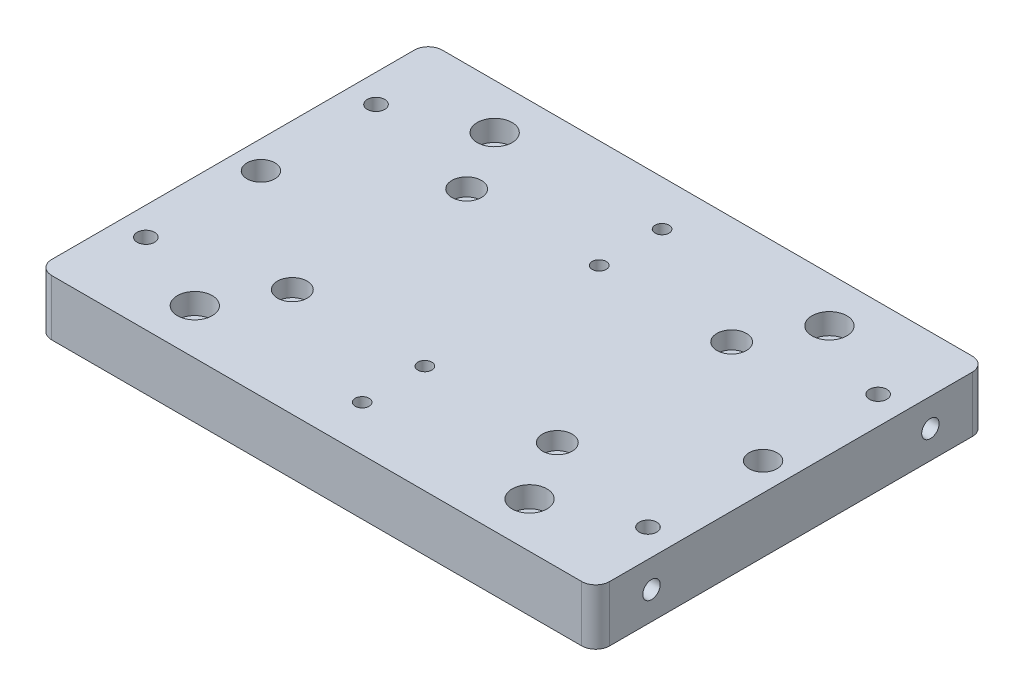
from build123d import *

# Parameters (mm, degrees)
SKETCH1_W                                         = 254
SKETCH1_H                                         = 177.8
BOSS_EXTRUDE1_DEPTH                               = 25.4
CBORE_FOR_5_16_SOCKET_HEAD_CAP_SCREW1_D           = 8.4328
CBORE_FOR_5_16_SOCKET_HEAD_CAP_SCREW1_CBORE_D     = 13.49502
CBORE_FOR_5_16_SOCKET_HEAD_CAP_SCREW1_CBORE_DEPTH = 7.9375
F_1_4_0_2500_DOWEL_HOLE1_D                        = 6.35
F_3_8_16_TAPPED_HOLE2_D                           = 7.9375
F_1_2_0_5000_DOWEL_HOLE1_D                        = 12.7
CBORE_FOR_3_8_SOCKET_HEAD_CAP_SCREW1_D            = 10.0838
CBORE_FOR_3_8_SOCKET_HEAD_CAP_SCREW1_CBORE_D      = 15.875
CBORE_FOR_3_8_SOCKET_HEAD_CAP_SCREW1_CBORE_DEPTH  = 9.525
F_1_4_0_2500_DOWEL_HOLE2_D                        = 6.35
F_3_8_16_TAPPED_HOLE1_AT_2_COUNT                  = 2
F_3_8_16_TAPPED_HOLE1_AT_2_PITCH                  = 127
FILLET1_R                                         = 6.35


with BuildPart() as part:
    # Sketch1 → Boss-Extrude1 (new body)
    with BuildSketch(Plane(origin=(0, 0, 0), x_dir=(1, 0, 0), z_dir=(0, 1, 0))):
        Rectangle(SKETCH1_W, SKETCH1_H)
    extrude(amount=BOSS_EXTRUDE1_DEPTH)

    # CBORE for 5_16 Socket Head Cap Screw1 (through all)
    with Locations(Plane(origin=(0, 25.4, 0), x_dir=(1, 0, 0), z_dir=(0, 1, 0))):
        with Locations((-60.325, 39.6875), (60.325, 39.6875), (60.325, -39.6875), (-60.325, -39.6875)):
            CounterBoreHole(CBORE_FOR_5_16_SOCKET_HEAD_CAP_SCREW1_D / 2, CBORE_FOR_5_16_SOCKET_HEAD_CAP_SCREW1_CBORE_D / 2, CBORE_FOR_5_16_SOCKET_HEAD_CAP_SCREW1_CBORE_DEPTH)

    # 1_4 _0.2500_ Dowel Hole1 (through all)
    with Locations(Plane(origin=(0, 25.4, 0), x_dir=(1, 0, 0), z_dir=(0, 1, 0))):
        with Locations((0, -39.6748), (0, 39.7002)):
            Hole(F_1_4_0_2500_DOWEL_HOLE1_D / 2)

    # 3_8-16 Tapped Hole2 (through all)
    with Locations(Plane(origin=(0, 25.4, 0), x_dir=(1, 0, 0), z_dir=(0, 1, 0))):
        with Locations((-114.3, 52.3875), (-114.3, -52.3875), (114.3, -52.3875), (114.3, 52.3875)):
            Hole(F_3_8_16_TAPPED_HOLE2_D / 2)

    # 1_2 _0.5000_ Dowel Hole1 (through all)
    with Locations(Plane(origin=(0, 25.4, 0), x_dir=(1, 0, 0), z_dir=(0, 1, 0))):
        with Locations((-114.3, 0), (114.3, 0)):
            Hole(F_1_2_0_5000_DOWEL_HOLE1_D / 2)

    # CBORE for 3_8 Socket Head Cap Screw1 (through all)
    with Locations(Plane(origin=(0, 25.4, 0), x_dir=(1, 0, 0), z_dir=(0, 1, 0))):
        with Locations((76.2, 68.3133), (-76.2, 68.3133), (-76.2, -68.2117), (76.2, -68.2117)):
            CounterBoreHole(CBORE_FOR_3_8_SOCKET_HEAD_CAP_SCREW1_D / 2, CBORE_FOR_3_8_SOCKET_HEAD_CAP_SCREW1_CBORE_D / 2, CBORE_FOR_3_8_SOCKET_HEAD_CAP_SCREW1_CBORE_DEPTH)

    # 1_4 _0.2500_ Dowel Hole2 (through all)
    with Locations(Plane(origin=(0, 0, 0), x_dir=(-1, 0, 0), z_dir=(0, -1, 0))):
        with Locations((0, 68.326), (0, -68.199)):
            Hole(F_1_4_0_2500_DOWEL_HOLE2_D / 2)

    # Sketch16 → 3_8-16 Tapped Hole1 (revolve, cut)
    with BuildSketch(Plane(origin=(-127, 12.7, 63.5), x_dir=(0, 0, 1), z_dir=(0, 1, 0))):
        Polygon((0, 0), (0, 18.386665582), (3.96875, 16.002), (3.96875, 0), align=None)
    f_3_8_16_tapped_hole1 = revolve(axis=Axis((-133.35, 12.7, 63.5), (1, 0, 0)), mode=Mode.SUBTRACT)

    # 3_8-16 Tapped Hole1 at 2: 3_8-16 Tapped Hole1 ×2
    with Locations(*[(0, 0, -i * F_3_8_16_TAPPED_HOLE1_AT_2_PITCH) for i in range(1, F_3_8_16_TAPPED_HOLE1_AT_2_COUNT)]):
        add(f_3_8_16_tapped_hole1, mode=Mode.SUBTRACT)

    # Fillet1
    fillet1_edges = [part.edges().sort_by_distance(p)[0] for p in [
        (127, 12.7, 88.9),
        (-127, 12.7, 88.9),
        (-127, 12.7, -88.9),
        (127, 12.7, -88.9),
    ]]
    fillet(fillet1_edges, radius=FILLET1_R)

    # Mirror1: 3_8-16 Tapped Hole1 across plane
    add(f_3_8_16_tapped_hole1.mirror(Plane(origin=(0, 0, 0), x_dir=(0, 0, 1), z_dir=(1, 0, 0))), mode=Mode.SUBTRACT)

    # Mirror1 copy 1 sketch → Mirror1 copy 1 (revolve, cut)
    with BuildSketch(Plane(origin=(127, 12.7, -63.5), x_dir=(0, 0, 1), z_dir=(0, 1, 0))):
        Polygon((0, 0), (0, -18.386665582), (3.96875, -16.002), (3.96875, 0), align=None)
    revolve(axis=Axis((133.35, 12.7, -63.5), (1, 0, 0)), mode=Mode.SUBTRACT)


solid = part.part
